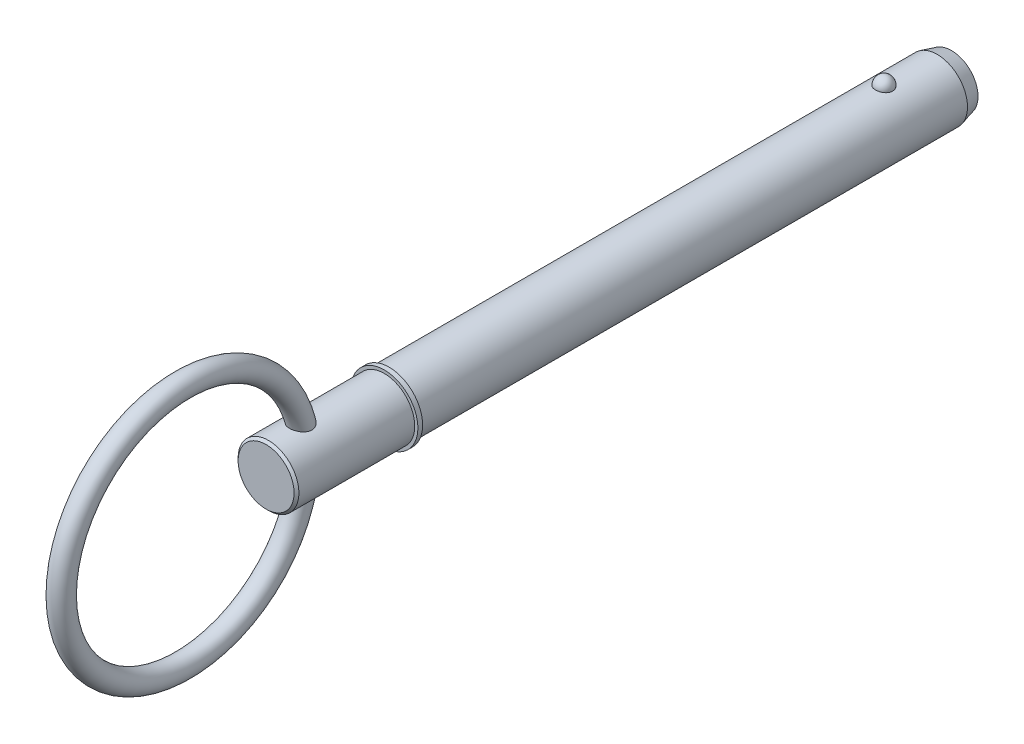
from build123d import *

# Parameters (mm, degrees)
SKETCH2_R           = 6.35
BOSS_EXTRUDE1_DEPTH = 101.6
BOSS_EXTRUDE2_START = 15.88
SKETCH3_R           = 6.35
BOSS_EXTRUDE2_DEPTH = 15.88
CHAMFER1_SIZE       = 3
CHAMFER1_SIZE2      = 0.803847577
SKETCH20_W          = 1
SKETCH20_H          = 7
SKETCH21_R          = 6.35
BOSS_EXTRUDE3_DEPTH = 25.7
CHAMFER2_SIZE       = 0.5
SKETCH24_R          = 2.25


with BuildPart() as part:
    # Sketch2 → Boss-Extrude1 (new body)
    with BuildSketch(Plane.XY):
        Circle(SKETCH2_R)
    extrude(amount=BOSS_EXTRUDE1_DEPTH)

    # Sketch3 → Boss-Extrude2 (add)
    with BuildSketch(Plane(origin=(0, 0, 0), x_dir=(-1, 0, 0), z_dir=(0, 0, -1)).offset(BOSS_EXTRUDE2_START)):
        Circle(SKETCH3_R)
    extrude(amount=-BOSS_EXTRUDE2_DEPTH)

    # Chamfer1
    chamfer1_edges = [part.edges().sort_by_distance(p)[0] for p in [
        (6.35, 0, -15.88),
    ]]
    chamfer1_side = [part.faces().sort_by_distance(p)[0] for p in [
        (6.35, 0, -7.94),
    ]]
    chamfer(chamfer1_edges, length=CHAMFER1_SIZE, length2=CHAMFER1_SIZE2, reference=chamfer1_side[0])

    # Sketch18 → Revolve1 (revolve)
    with BuildSketch(Plane(origin=(0, 0, 0), x_dir=(0, 0, -1), z_dir=(1, 0, 0))):
        with BuildLine():
            Line((1.78, 8.13), (1.78, 4.57))
            ThreePointArc((1.78, 4.57), (0, 6.35), (1.78, 8.13))
        make_face()
    revolve(axis=Axis((0, 8.13, -1.78), (0, -1, 0)))

    # Sketch20 → Revolve2 (revolve)
    with BuildSketch(Plane(origin=(0, 0, 0), x_dir=(0, 0, -1), z_dir=(1, 0, 0)), mode=Mode.PRIVATE) as revolve2_sk:
        with Locations((-102.1, 3.5)):
            Rectangle(SKETCH20_W, SKETCH20_H)
    revolve(revolve2_sk.sketch.rotate(Axis((0, 0, 33.728787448), (0, 0, 1)), 90), axis=Axis((0, 0, 33.728787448), (0, 0, 1)))

    # Sketch21 → Boss-Extrude3 (add)
    with BuildSketch(Plane(origin=(0, 0, 101.6), x_dir=(-1, 0, 0), z_dir=(0, 0, -1))):
        Circle(SKETCH21_R)
    extrude(amount=-BOSS_EXTRUDE3_DEPTH)

    # Chamfer2
    chamfer2_edges = [part.edges().sort_by_distance(p)[0] for p in [
        (6.35, 0, 127.3),
    ]]
    chamfer(chamfer2_edges, length=CHAMFER2_SIZE)

    # Sweep1: sweep along a path in Sketch23
    with BuildLine(Plane(origin=(0, 0, 0), x_dir=(0, 0, -1), z_dir=(1, 0, 0))) as sweep1_path:
        CenterArc((-144.7, 0), 25.4, 0, 360)
    # Sketch24 → Sweep1 (sweep)
    with BuildSketch(Plane(origin=(0, 0, 0), x_dir=(1, 0, 0), z_dir=(0, 1, 0))):
        with Locations((0, -119.3)):
            Circle(SKETCH24_R)
    sweep(path=sweep1_path.line)


solid = part.part
